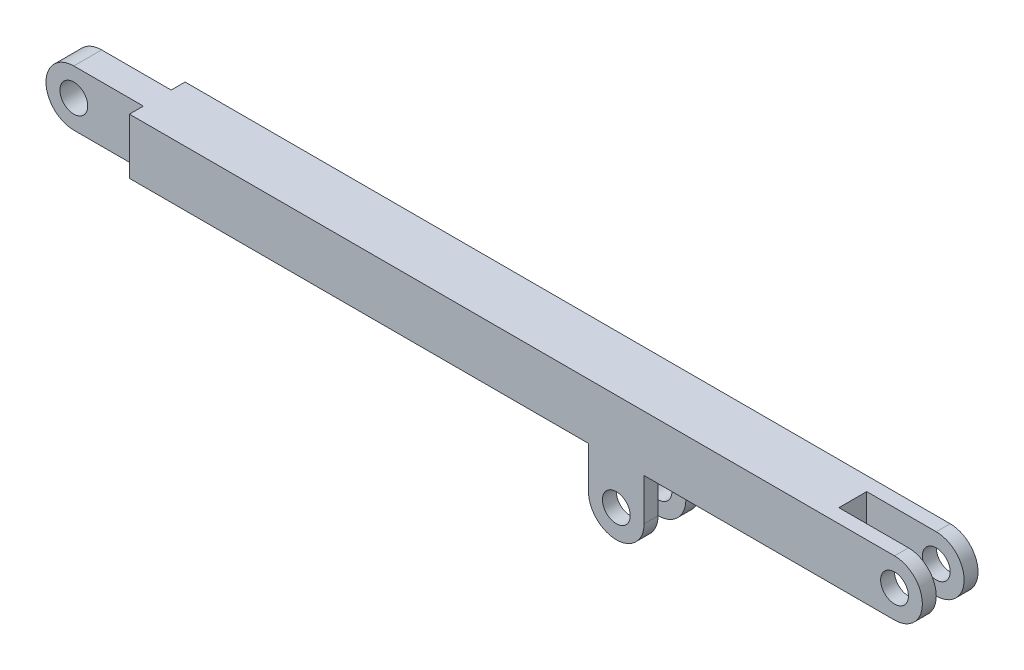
from build123d import *

# Parameters (mm, degrees)
SZKIC1_R                    = 20
DODANIE_WYCI_GNI_CIE1_DEPTH = 20
SZKIC2_R                    = 20
DODANIE_WYCI_GNI_CIE2_DEPTH = 40
SZKIC3_R                    = 20
WYTNIJ_WYCI_GNI_CIE1_DEPTH  = 20
SZKIC4_R                    = 20
DODANIE_WYCI_GNI_CIE3_DEPTH = 40
SZKIC4_2_R                  = 20
WYTNIJ_WYCI_GNI_CIE2_DEPTH  = 20


with BuildPart() as part:
    # Szkic1 → Dodanie-wyci_gni_cie1 (new, symmetric)
    with BuildSketch(Plane.XY):
        with BuildLine():
            Line((0, 40), (1200, 40))
            ThreePointArc((1200, 40), (1240, 0), (1200, -40))
            Line((1200, -40), (0, -40))
            ThreePointArc((0, -40), (-40, 0), (0, 40))
        make_face()
        Circle(SZKIC1_R, mode=Mode.SUBTRACT)
        with Locations((1200, 0)):
            Circle(SZKIC1_R, mode=Mode.SUBTRACT)
    extrude(amount=DODANIE_WYCI_GNI_CIE1_DEPTH, both=True)

    # Szkic2 → Dodanie-wyci_gni_cie2 (add, symmetric)
    with BuildSketch(Plane.XY):
        with BuildLine():
            Line((100, 40), (1200, 40))
            ThreePointArc((1200, 40), (1240, 0), (1200, -40))
            Line((1200, -40), (100, -40))
            Line((100, -40), (100, 40))
        make_face()
        with Locations((1200, 0)):
            Circle(SZKIC2_R, mode=Mode.SUBTRACT)
    extrude(amount=DODANIE_WYCI_GNI_CIE2_DEPTH, both=True)

    # Szkic3 → Wytnij-wyci_gni_cie1 (cut, symmetric)
    with BuildSketch(Plane.XY):
        with BuildLine():
            Line((1100, 40), (1200, 40))
            ThreePointArc((1200, 40), (1240, 0), (1200, -40))
            Line((1200, -40), (1100, -40))
            Line((1100, -40), (1100, 40))
        make_face()
        with Locations((1200, 0)):
            Circle(SZKIC3_R, mode=Mode.SUBTRACT)
    extrude(amount=WYTNIJ_WYCI_GNI_CIE1_DEPTH, both=True, mode=Mode.SUBTRACT)

    # Szkic4 → Dodanie-wyci_gni_cie3 (add, symmetric)
    with BuildSketch(Plane.XY):
        with BuildLine():
            Line((760, -40), (840, -40))
            Line((840, -40), (840, -100))
            ThreePointArc((840, -100), (800, -140), (760, -100))
            Line((760, -100), (760, -40))
        make_face()
        with Locations((800, -100)):
            Circle(SZKIC4_R, mode=Mode.SUBTRACT)
    extrude(amount=DODANIE_WYCI_GNI_CIE3_DEPTH, both=True)

    # Szkic4_2 → Wytnij-wyci_gni_cie2 (cut, symmetric)
    with BuildSketch(Plane.XY):
        with BuildLine():
            Line((760, -40), (840, -40))
            Line((840, -40), (840, -100))
            ThreePointArc((840, -100), (800, -140), (760, -100))
            Line((760, -100), (760, -40))
        make_face()
        with Locations((800, -100)):
            Circle(SZKIC4_2_R, mode=Mode.SUBTRACT)
    extrude(amount=WYTNIJ_WYCI_GNI_CIE2_DEPTH, both=True, mode=Mode.SUBTRACT)


solid = part.part
